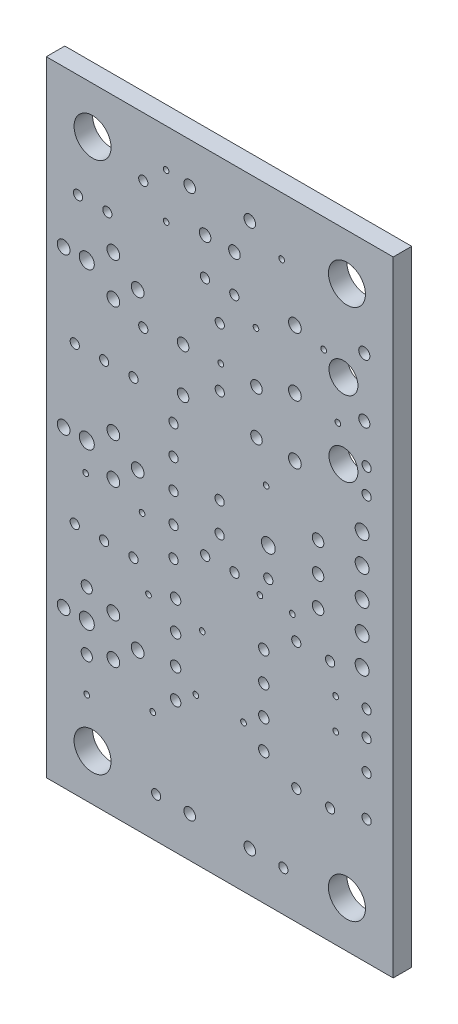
from build123d import *

# Parameters (mm, degrees)
ESQUISSE1_W      = 29.99994
ESQUISSE1_H      = 54.0004
ESQUISSE1_R      = 0.50038
ESQUISSE1_R_2    = 0.4826
ESQUISSE1_R_3    = 0.39878
ESQUISSE1_R_4    = 0.55118
ESQUISSE1_R_5    = 0.65024
ESQUISSE1_R_6    = 1.6002
ESQUISSE1_R_7    = 0.44958
ESQUISSE1_R_8    = 1.24968
ESQUISSE1_R_9    = 0.59944
ESQUISSE1_R_10   = 0.24384
EXTRUSION1_DEPTH = 1.6


with BuildPart() as part:
    # Esquisse1 → Extrusion1 (new body)
    with BuildSketch(Plane.XY):
        with Locations((14.99997, 27.0002)):
            Rectangle(ESQUISSE1_W, ESQUISSE1_H)
        with Locations((18.17624, 38.36416)):
            Circle(ESQUISSE1_R, mode=Mode.SUBTRACT)
        with Locations((18.17624, 34.55416)):
            Circle(ESQUISSE1_R, mode=Mode.SUBTRACT)
        with Locations((11.82624, 34.55416)):
            Circle(ESQUISSE1_R, mode=Mode.SUBTRACT)
        with Locations((11.82624, 38.36416)):
            Circle(ESQUISSE1_R, mode=Mode.SUBTRACT)
        with Locations((17.59966, 3.50012)):
            Circle(ESQUISSE1_R, mode=Mode.SUBTRACT)
        with Locations((12.40028, 3.50012)):
            Circle(ESQUISSE1_R, mode=Mode.SUBTRACT)
        with Locations((12.40028, 50.50028)):
            Circle(ESQUISSE1_R, mode=Mode.SUBTRACT)
        with Locations((17.59966, 50.50028)):
            Circle(ESQUISSE1_R, mode=Mode.SUBTRACT)
        with Locations((3.50012, 10.9601)):
            Circle(ESQUISSE1_R_2, mode=Mode.SUBTRACT)
        with Locations((3.50012, 16.0401)):
            Circle(ESQUISSE1_R_2, mode=Mode.SUBTRACT)
        with Locations((27.50058, 40.45966)):
            Circle(ESQUISSE1_R_2, mode=Mode.SUBTRACT)
        with Locations((27.50058, 45.53966)):
            Circle(ESQUISSE1_R_2, mode=Mode.SUBTRACT)
        with Locations((16.27124, 47.50054)):
            Circle(ESQUISSE1_R, mode=Mode.SUBTRACT)
        with Locations((13.73124, 47.50054)):
            Circle(ESQUISSE1_R, mode=Mode.SUBTRACT)
        with Locations((27.70124, 14.2494)):
            Circle(ESQUISSE1_R_3, mode=Mode.SUBTRACT)
        with Locations((27.70124, 10.74928)):
            Circle(ESQUISSE1_R_3, mode=Mode.SUBTRACT)
        with Locations((1.4986, 13.5001)):
            Circle(ESQUISSE1_R_4, mode=Mode.SUBTRACT)
        with Locations((7.8994, 13.5001)):
            Circle(ESQUISSE1_R_4, mode=Mode.SUBTRACT)
        with Locations((5.79882, 11.75004)):
            Circle(ESQUISSE1_R_4, mode=Mode.SUBTRACT)
        with Locations((5.79882, 15.25016)):
            Circle(ESQUISSE1_R_4, mode=Mode.SUBTRACT)
        with Locations((3.50012, 13.5001)):
            Circle(ESQUISSE1_R_5, mode=Mode.SUBTRACT)
        with Locations((1.4986, 27.0002)):
            Circle(ESQUISSE1_R_4, mode=Mode.SUBTRACT)
        with Locations((7.8994, 27.0002)):
            Circle(ESQUISSE1_R_4, mode=Mode.SUBTRACT)
        with Locations((5.79882, 25.25014)):
            Circle(ESQUISSE1_R_4, mode=Mode.SUBTRACT)
        with Locations((5.79882, 28.75026)):
            Circle(ESQUISSE1_R_4, mode=Mode.SUBTRACT)
        with Locations((3.50012, 27.0002)):
            Circle(ESQUISSE1_R_5, mode=Mode.SUBTRACT)
        with Locations((1.4986, 40.5003)):
            Circle(ESQUISSE1_R_4, mode=Mode.SUBTRACT)
        with Locations((7.8994, 40.5003)):
            Circle(ESQUISSE1_R_4, mode=Mode.SUBTRACT)
        with Locations((5.79882, 38.75024)):
            Circle(ESQUISSE1_R_4, mode=Mode.SUBTRACT)
        with Locations((5.79882, 42.25036)):
            Circle(ESQUISSE1_R_4, mode=Mode.SUBTRACT)
        with Locations((3.50012, 40.5003)):
            Circle(ESQUISSE1_R_5, mode=Mode.SUBTRACT)
        with Locations((15.00124, 36.45916)):
            Circle(ESQUISSE1_R_3, mode=Mode.SUBTRACT)
        with Locations((15.00124, 41.53916)):
            Circle(ESQUISSE1_R_3, mode=Mode.SUBTRACT)
        with Locations((4.0005, 49.9999)):
            Circle(ESQUISSE1_R_6, mode=Mode.SUBTRACT)
        with Locations((25.99944, 49.9999)):
            Circle(ESQUISSE1_R_6, mode=Mode.SUBTRACT)
        with Locations((4.0005, 4.0005)):
            Circle(ESQUISSE1_R_6, mode=Mode.SUBTRACT)
        with Locations((25.99944, 4.0005)):
            Circle(ESQUISSE1_R_6, mode=Mode.SUBTRACT)
        with Locations((18.80616, 11.38428)):
            Circle(ESQUISSE1_R_7, mode=Mode.SUBTRACT)
        with Locations((18.80616, 13.92428)):
            Circle(ESQUISSE1_R_7, mode=Mode.SUBTRACT)
        with Locations((18.80616, 16.46428)):
            Circle(ESQUISSE1_R_7, mode=Mode.SUBTRACT)
        with Locations((18.80616, 19.00428)):
            Circle(ESQUISSE1_R_7, mode=Mode.SUBTRACT)
        with Locations((11.18616, 19.00428)):
            Circle(ESQUISSE1_R_7, mode=Mode.SUBTRACT)
        with Locations((11.18616, 16.46428)):
            Circle(ESQUISSE1_R_7, mode=Mode.SUBTRACT)
        with Locations((11.18616, 13.92428)):
            Circle(ESQUISSE1_R_7, mode=Mode.SUBTRACT)
        with Locations((11.18616, 11.38428)):
            Circle(ESQUISSE1_R_7, mode=Mode.SUBTRACT)
        with Locations((2.46126, 33.74898)):
            Circle(ESQUISSE1_R_3, mode=Mode.SUBTRACT)
        with Locations((5.00126, 33.74898)):
            Circle(ESQUISSE1_R_3, mode=Mode.SUBTRACT)
        with Locations((7.54126, 33.74898)):
            Circle(ESQUISSE1_R_3, mode=Mode.SUBTRACT)
        with Locations((2.46126, 20.24888)):
            Circle(ESQUISSE1_R_3, mode=Mode.SUBTRACT)
        with Locations((5.00126, 20.24888)):
            Circle(ESQUISSE1_R_3, mode=Mode.SUBTRACT)
        with Locations((7.54126, 20.24888)):
            Circle(ESQUISSE1_R_3, mode=Mode.SUBTRACT)
        with Locations((5.28066, 45.01134)):
            Circle(ESQUISSE1_R_3, mode=Mode.SUBTRACT)
        with Locations((2.74066, 45.01134)):
            Circle(ESQUISSE1_R_3, mode=Mode.SUBTRACT)
        with Locations((14.98854, 28.28036)):
            Circle(ESQUISSE1_R_3, mode=Mode.SUBTRACT)
        with Locations((14.98854, 25.74036)):
            Circle(ESQUISSE1_R_3, mode=Mode.SUBTRACT)
        with Locations((16.2814, 23.51024)):
            Circle(ESQUISSE1_R_3, mode=Mode.SUBTRACT)
        with Locations((13.7414, 23.51024)):
            Circle(ESQUISSE1_R_3, mode=Mode.SUBTRACT)
        with Locations((13.71854, 44.28744)):
            Circle(ESQUISSE1_R_3, mode=Mode.SUBTRACT)
        with Locations((16.25854, 44.28744)):
            Circle(ESQUISSE1_R_3, mode=Mode.SUBTRACT)
        with Locations((21.49856, 44.63542)):
            Circle(ESQUISSE1_R_4, mode=Mode.SUBTRACT)
        with Locations((21.49856, 39.55288)):
            Circle(ESQUISSE1_R_4, mode=Mode.SUBTRACT)
        with Locations((21.49856, 34.47288)):
            Circle(ESQUISSE1_R_4, mode=Mode.SUBTRACT)
        with Locations((25.69718, 42.84218)):
            Circle(ESQUISSE1_R_8, mode=Mode.SUBTRACT)
        with Locations((25.69718, 36.34232)):
            Circle(ESQUISSE1_R_8, mode=Mode.SUBTRACT)
        with Locations((23.50008, 29.5402)):
            Circle(ESQUISSE1_R, mode=Mode.SUBTRACT)
        with Locations((23.50008, 27.0002)):
            Circle(ESQUISSE1_R, mode=Mode.SUBTRACT)
        with Locations((23.50008, 24.4602)):
            Circle(ESQUISSE1_R, mode=Mode.SUBTRACT)
        with Locations((20.50034, 3.50012)):
            Circle(ESQUISSE1_R_3, mode=Mode.SUBTRACT)
        with Locations((9.4996, 3.50012)):
            Circle(ESQUISSE1_R_3, mode=Mode.SUBTRACT)
        with Locations((8.38454, 48.90262)):
            Circle(ESQUISSE1_R_3, mode=Mode.SUBTRACT)
        with Locations((8.38454, 37.90188)):
            Circle(ESQUISSE1_R_3, mode=Mode.SUBTRACT)
        with Locations((21.62048, 9.99998)):
            Circle(ESQUISSE1_R_3, mode=Mode.SUBTRACT)
        with Locations((21.62048, 21.00072)):
            Circle(ESQUISSE1_R_3, mode=Mode.SUBTRACT)
        with Locations((24.54402, 9.99998)):
            Circle(ESQUISSE1_R_3, mode=Mode.SUBTRACT)
        with Locations((24.54402, 21.00072)):
            Circle(ESQUISSE1_R_3, mode=Mode.SUBTRACT)
        with Locations((27.70124, 16.8402)):
            Circle(ESQUISSE1_R_3, mode=Mode.SUBTRACT)
        with Locations((27.70124, 37.1602)):
            Circle(ESQUISSE1_R_3, mode=Mode.SUBTRACT)
        with Locations((27.70124, 18.9992)):
            Circle(ESQUISSE1_R_3, mode=Mode.SUBTRACT)
        with Locations((27.70124, 35.0012)):
            Circle(ESQUISSE1_R_3, mode=Mode.SUBTRACT)
        with Locations((27.31008, 27.0002)):
            Circle(ESQUISSE1_R_9, mode=Mode.SUBTRACT)
        with Locations((27.31008, 29.5402)):
            Circle(ESQUISSE1_R_9, mode=Mode.SUBTRACT)
        with Locations((27.31008, 32.0802)):
            Circle(ESQUISSE1_R_9, mode=Mode.SUBTRACT)
        with Locations((27.31008, 24.4602)):
            Circle(ESQUISSE1_R_9, mode=Mode.SUBTRACT)
        with Locations((27.31008, 21.9202)):
            Circle(ESQUISSE1_R_9, mode=Mode.SUBTRACT)
        with Locations((19.19986, 27.0002)):
            Circle(ESQUISSE1_R_9, mode=Mode.SUBTRACT)
        with Locations((19.19986, 24.50084)):
            Circle(ESQUISSE1_R_3, mode=Mode.SUBTRACT)
        with Locations((11.00328, 32.07004)):
            Circle(ESQUISSE1_R_3, mode=Mode.SUBTRACT)
        with Locations((11.00328, 29.53004)):
            Circle(ESQUISSE1_R_3, mode=Mode.SUBTRACT)
        with Locations((11.00328, 26.99004)):
            Circle(ESQUISSE1_R_3, mode=Mode.SUBTRACT)
        with Locations((11.00328, 24.45004)):
            Circle(ESQUISSE1_R_3, mode=Mode.SUBTRACT)
        with Locations((11.00328, 21.91004)):
            Circle(ESQUISSE1_R_3, mode=Mode.SUBTRACT)
        with Locations((3.4036, 24.51608)):
            Circle(ESQUISSE1_R_10, mode=Mode.SUBTRACT)
        with Locations((8.2804, 23.96998)):
            Circle(ESQUISSE1_R_10, mode=Mode.SUBTRACT)
        with Locations((8.8392, 18.14322)):
            Circle(ESQUISSE1_R_10, mode=Mode.SUBTRACT)
        with Locations((13.48994, 17.71904)):
            Circle(ESQUISSE1_R_10, mode=Mode.SUBTRACT)
        with Locations((18.13306, 42.75582)):
            Circle(ESQUISSE1_R_10, mode=Mode.SUBTRACT)
        with Locations((3.50012, 7.97306)):
            Circle(ESQUISSE1_R_10, mode=Mode.SUBTRACT)
        with Locations((9.2075, 9.52754)):
            Circle(ESQUISSE1_R_10, mode=Mode.SUBTRACT)
        with Locations((25.02662, 15.9766)):
            Circle(ESQUISSE1_R_10, mode=Mode.SUBTRACT)
        with Locations((25.02662, 18.62328)):
            Circle(ESQUISSE1_R_10, mode=Mode.SUBTRACT)
        with Locations((20.35556, 49.00676)):
            Circle(ESQUISSE1_R_10, mode=Mode.SUBTRACT)
        with Locations((21.28012, 22.91334)):
            Circle(ESQUISSE1_R_10, mode=Mode.SUBTRACT)
        with Locations((18.47342, 22.91334)):
            Circle(ESQUISSE1_R_10, mode=Mode.SUBTRACT)
        with Locations((19.00936, 31.3817)):
            Circle(ESQUISSE1_R_10, mode=Mode.SUBTRACT)
        with Locations((12.93114, 12.67206)):
            Circle(ESQUISSE1_R_10, mode=Mode.SUBTRACT)
        with Locations((17.0561, 12.67206)):
            Circle(ESQUISSE1_R_10, mode=Mode.SUBTRACT)
        with Locations((10.36066, 50.69332)):
            Circle(ESQUISSE1_R_10, mode=Mode.SUBTRACT)
        with Locations((10.36066, 46.81474)):
            Circle(ESQUISSE1_R_10, mode=Mode.SUBTRACT)
        with Locations((25.21458, 39.18966)):
            Circle(ESQUISSE1_R_10, mode=Mode.SUBTRACT)
        with Locations((23.9903, 44.0563)):
            Circle(ESQUISSE1_R_10, mode=Mode.SUBTRACT)
        with Locations((15.09014, 38.57244)):
            Circle(ESQUISSE1_R_10, mode=Mode.SUBTRACT)
    extrude(amount=EXTRUSION1_DEPTH)


solid = part.part
